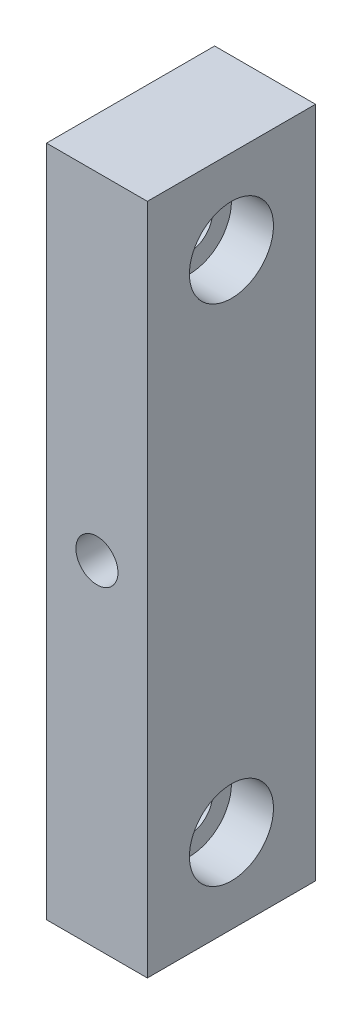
ISO-10303-21;
HEADER;
FILE_DESCRIPTION(('STEP AP214'),'2;1');
FILE_NAME('part.step','',(''),(''),'','','');
FILE_SCHEMA(('AUTOMOTIVE_DESIGN { 1 0 10303 214 1 1 1 1 }'));
ENDSEC;
DATA;
#1=APPLICATION_CONTEXT('core data for automotive mechanical design processes');
#2=APPLICATION_PROTOCOL_DEFINITION('international standard','automotive_design',2000,#1);
#3=PRODUCT_CONTEXT('',#1,'mechanical');
#4=PRODUCT('Part','Part','',(#3));
#5=PRODUCT_RELATED_PRODUCT_CATEGORY('part','',(#4));
#6=PRODUCT_DEFINITION_FORMATION('','',#4);
#7=PRODUCT_DEFINITION_CONTEXT('part definition',#1,'design');
#8=PRODUCT_DEFINITION('design','',#6,#7);
#9=PRODUCT_DEFINITION_SHAPE('','',#8);
#10=(LENGTH_UNIT() NAMED_UNIT(*) SI_UNIT(.MILLI.,.METRE.));
#11=(NAMED_UNIT(*) PLANE_ANGLE_UNIT() SI_UNIT($,.RADIAN.));
#12=(NAMED_UNIT(*) SI_UNIT($,.STERADIAN.) SOLID_ANGLE_UNIT());
#13=UNCERTAINTY_MEASURE_WITH_UNIT(LENGTH_MEASURE(1.E-05),#10,'distance_accuracy_value','');
#14=(GEOMETRIC_REPRESENTATION_CONTEXT(3) GLOBAL_UNCERTAINTY_ASSIGNED_CONTEXT((#13)) GLOBAL_UNIT_ASSIGNED_CONTEXT((#10,
#11,#12)) REPRESENTATION_CONTEXT('',''));
#15=CARTESIAN_POINT('',(0.,0.,0.));
#16=DIRECTION('',(0.,0.,1.));
#17=DIRECTION('',(1.,0.,0.));
#18=AXIS2_PLACEMENT_3D('',#15,#16,#17);
#19=CARTESIAN_POINT('',(7.,-30.,0.));
#20=DIRECTION('',(1.,0.,0.));
#21=DIRECTION('',(0.,0.,-1.));
#22=AXIS2_PLACEMENT_3D('',#19,#20,#21);
#23=CYLINDRICAL_SURFACE('',#22,5.);
#24=CARTESIAN_POINT('',(12.,-30.,0.));
#25=DIRECTION('',(1.,0.,0.));
#26=DIRECTION('',(0.,0.,-1.));
#27=AXIS2_PLACEMENT_3D('',#24,#25,#26);
#28=CIRCLE('',#27,5.);
#29=CARTESIAN_POINT('',(12.,-30.,-4.99999999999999));
#30=VERTEX_POINT('',#29);
#31=EDGE_CURVE('E105',#30,#30,#28,.F.);
#32=ORIENTED_EDGE('',*,*,#31,.F.);
#33=EDGE_LOOP('',(#32));
#34=FACE_BOUND('',#33,.T.);
#35=CARTESIAN_POINT('',(7.,-30.,0.));
#36=DIRECTION('',(1.,0.,0.));
#37=DIRECTION('',(0.,0.,-1.));
#38=AXIS2_PLACEMENT_3D('',#35,#36,#37);
#39=CIRCLE('',#38,5.);
#40=CARTESIAN_POINT('',(7.,-30.,-4.99999999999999));
#41=VERTEX_POINT('',#40);
#42=EDGE_CURVE('E20',#41,#41,#39,.T.);
#43=ORIENTED_EDGE('',*,*,#42,.F.);
#44=EDGE_LOOP('',(#43));
#45=FACE_BOUND('',#44,.T.);
#46=ADVANCED_FACE('F17',(#34,#45),#23,.F.);
#47=CARTESIAN_POINT('',(7.,30.,0.));
#48=DIRECTION('',(1.,0.,0.));
#49=DIRECTION('',(0.,0.,-1.));
#50=AXIS2_PLACEMENT_3D('',#47,#48,#49);
#51=CYLINDRICAL_SURFACE('',#50,5.);
#52=CARTESIAN_POINT('',(12.,30.,0.));
#53=DIRECTION('',(1.,0.,0.));
#54=DIRECTION('',(0.,0.,-1.));
#55=AXIS2_PLACEMENT_3D('',#52,#53,#54);
#56=CIRCLE('',#55,5.);
#57=CARTESIAN_POINT('',(12.,30.,-4.99999999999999));
#58=VERTEX_POINT('',#57);
#59=EDGE_CURVE('E102',#58,#58,#56,.F.);
#60=ORIENTED_EDGE('',*,*,#59,.F.);
#61=EDGE_LOOP('',(#60));
#62=FACE_BOUND('',#61,.T.);
#63=CARTESIAN_POINT('',(7.,30.,0.));
#64=DIRECTION('',(1.,0.,0.));
#65=DIRECTION('',(0.,0.,-1.));
#66=AXIS2_PLACEMENT_3D('',#63,#64,#65);
#67=CIRCLE('',#66,5.);
#68=CARTESIAN_POINT('',(7.,30.,-4.99999999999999));
#69=VERTEX_POINT('',#68);
#70=EDGE_CURVE('E107',#69,#69,#67,.T.);
#71=ORIENTED_EDGE('',*,*,#70,.F.);
#72=EDGE_LOOP('',(#71));
#73=FACE_BOUND('',#72,.T.);
#74=ADVANCED_FACE('F117',(#62,#73),#51,.F.);
#75=CARTESIAN_POINT('',(7.,-30.,0.));
#76=DIRECTION('',(1.,0.,0.));
#77=DIRECTION('',(0.,0.,-1.));
#78=AXIS2_PLACEMENT_3D('',#75,#76,#77);
#79=PLANE('',#78);
#80=CARTESIAN_POINT('',(7.,-30.,0.));
#81=DIRECTION('',(1.,0.,0.));
#82=DIRECTION('',(0.,0.,-1.));
#83=AXIS2_PLACEMENT_3D('',#80,#81,#82);
#84=CIRCLE('',#83,2.75);
#85=CARTESIAN_POINT('',(7.,-30.,-2.74999999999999));
#86=VERTEX_POINT('',#85);
#87=EDGE_CURVE('E99',#86,#86,#84,.F.);
#88=ORIENTED_EDGE('',*,*,#87,.T.);
#89=EDGE_LOOP('',(#88));
#90=FACE_BOUND('',#89,.T.);
#91=ORIENTED_EDGE('',*,*,#42,.T.);
#92=EDGE_LOOP('',(#91));
#93=FACE_BOUND('',#92,.T.);
#94=ADVANCED_FACE('F114',(#90,#93),#79,.T.);
#95=CARTESIAN_POINT('',(7.,30.,0.));
#96=DIRECTION('',(1.,0.,0.));
#97=DIRECTION('',(0.,0.,-1.));
#98=AXIS2_PLACEMENT_3D('',#95,#96,#97);
#99=PLANE('',#98);
#100=CARTESIAN_POINT('',(7.,30.,0.));
#101=DIRECTION('',(1.,0.,0.));
#102=DIRECTION('',(0.,0.,-1.));
#103=AXIS2_PLACEMENT_3D('',#100,#101,#102);
#104=CIRCLE('',#103,2.75);
#105=CARTESIAN_POINT('',(7.,30.,-2.74999999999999));
#106=VERTEX_POINT('',#105);
#107=EDGE_CURVE('E67',#106,#106,#104,.F.);
#108=ORIENTED_EDGE('',*,*,#107,.T.);
#109=EDGE_LOOP('',(#108));
#110=FACE_BOUND('',#109,.T.);
#111=ORIENTED_EDGE('',*,*,#70,.T.);
#112=EDGE_LOOP('',(#111));
#113=FACE_BOUND('',#112,.T.);
#114=ADVANCED_FACE('F158',(#110,#113),#99,.T.);
#115=CARTESIAN_POINT('',(6.,0.,10.));
#116=DIRECTION('',(0.,0.,1.));
#117=DIRECTION('',(1.,0.,0.));
#118=AXIS2_PLACEMENT_3D('',#115,#116,#117);
#119=CYLINDRICAL_SURFACE('',#118,2.49999999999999);
#120=CARTESIAN_POINT('',(6.,0.,-10.));
#121=DIRECTION('',(0.,0.,1.));
#122=DIRECTION('',(1.,0.,0.));
#123=AXIS2_PLACEMENT_3D('',#120,#121,#122);
#124=CIRCLE('',#123,2.49999999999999);
#125=CARTESIAN_POINT('',(8.49999999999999,0.,-10.));
#126=VERTEX_POINT('',#125);
#127=EDGE_CURVE('E93',#126,#126,#124,.F.);
#128=ORIENTED_EDGE('',*,*,#127,.T.);
#129=EDGE_LOOP('',(#128));
#130=FACE_BOUND('',#129,.T.);
#131=CARTESIAN_POINT('',(6.,0.,10.));
#132=DIRECTION('',(0.,0.,1.));
#133=DIRECTION('',(1.,0.,0.));
#134=AXIS2_PLACEMENT_3D('',#131,#132,#133);
#135=CIRCLE('',#134,2.49999999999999);
#136=CARTESIAN_POINT('',(8.49999999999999,0.,10.));
#137=VERTEX_POINT('',#136);
#138=EDGE_CURVE('E66',#137,#137,#135,.T.);
#139=ORIENTED_EDGE('',*,*,#138,.T.);
#140=EDGE_LOOP('',(#139));
#141=FACE_BOUND('',#140,.T.);
#142=ADVANCED_FACE('F155',(#130,#141),#119,.F.);
#143=CARTESIAN_POINT('',(12.,0.,0.));
#144=DIRECTION('',(1.,0.,0.));
#145=DIRECTION('',(0.,0.,-1.));
#146=AXIS2_PLACEMENT_3D('',#143,#144,#145);
#147=PLANE('',#146);
#148=DIRECTION('',(0.,1.,0.));
#149=VECTOR('',#148,1.);
#150=CARTESIAN_POINT('',(12.,40.,10.));
#151=LINE('',#150,#149);
#152=CARTESIAN_POINT('',(12.,40.,10.));
#153=VERTEX_POINT('',#152);
#154=CARTESIAN_POINT('',(12.,-40.,10.));
#155=VERTEX_POINT('',#154);
#156=EDGE_CURVE('E55',#153,#155,#151,.F.);
#157=ORIENTED_EDGE('',*,*,#156,.T.);
#158=DIRECTION('',(0.,0.,1.));
#159=VECTOR('',#158,1.);
#160=CARTESIAN_POINT('',(12.,-40.,10.));
#161=LINE('',#160,#159);
#162=CARTESIAN_POINT('',(12.,-40.,-10.));
#163=VERTEX_POINT('',#162);
#164=EDGE_CURVE('E95',#155,#163,#161,.F.);
#165=ORIENTED_EDGE('',*,*,#164,.T.);
#166=DIRECTION('',(0.,-1.,0.));
#167=VECTOR('',#166,1.);
#168=CARTESIAN_POINT('',(12.,40.,-9.99999999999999));
#169=LINE('',#168,#167);
#170=CARTESIAN_POINT('',(12.,40.,-10.));
#171=VERTEX_POINT('',#170);
#172=EDGE_CURVE('E61',#163,#171,#169,.F.);
#173=ORIENTED_EDGE('',*,*,#172,.T.);
#174=DIRECTION('',(0.,0.,-1.));
#175=VECTOR('',#174,1.);
#176=CARTESIAN_POINT('',(12.,40.,10.));
#177=LINE('',#176,#175);
#178=EDGE_CURVE('E58',#171,#153,#177,.F.);
#179=ORIENTED_EDGE('',*,*,#178,.T.);
#180=EDGE_LOOP('',(#157,#165,#173,#179));
#181=FACE_BOUND('',#180,.T.);
#182=ORIENTED_EDGE('',*,*,#59,.T.);
#183=EDGE_LOOP('',(#182));
#184=FACE_BOUND('',#183,.T.);
#185=ORIENTED_EDGE('',*,*,#31,.T.);
#186=EDGE_LOOP('',(#185));
#187=FACE_BOUND('',#186,.T.);
#188=ADVANCED_FACE('F59',(#181,#184,#187),#147,.T.);
#189=CARTESIAN_POINT('',(0.,-30.,0.));
#190=DIRECTION('',(1.,0.,0.));
#191=DIRECTION('',(0.,0.,-1.));
#192=AXIS2_PLACEMENT_3D('',#189,#190,#191);
#193=CYLINDRICAL_SURFACE('',#192,2.75);
#194=CARTESIAN_POINT('',(0.,-30.,0.));
#195=DIRECTION('',(1.,0.,0.));
#196=DIRECTION('',(0.,0.,-1.));
#197=AXIS2_PLACEMENT_3D('',#194,#195,#196);
#198=CIRCLE('',#197,2.75);
#199=CARTESIAN_POINT('',(0.,-30.,-2.74999999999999));
#200=VERTEX_POINT('',#199);
#201=EDGE_CURVE('E89',#200,#200,#198,.F.);
#202=ORIENTED_EDGE('',*,*,#201,.T.);
#203=EDGE_LOOP('',(#202));
#204=FACE_BOUND('',#203,.T.);
#205=ORIENTED_EDGE('',*,*,#87,.F.);
#206=EDGE_LOOP('',(#205));
#207=FACE_BOUND('',#206,.T.);
#208=ADVANCED_FACE('F148',(#204,#207),#193,.F.);
#209=CARTESIAN_POINT('',(0.,30.,0.));
#210=DIRECTION('',(1.,0.,0.));
#211=DIRECTION('',(0.,0.,-1.));
#212=AXIS2_PLACEMENT_3D('',#209,#210,#211);
#213=CYLINDRICAL_SURFACE('',#212,2.75);
#214=CARTESIAN_POINT('',(0.,30.,0.));
#215=DIRECTION('',(1.,0.,0.));
#216=DIRECTION('',(0.,0.,-1.));
#217=AXIS2_PLACEMENT_3D('',#214,#215,#216);
#218=CIRCLE('',#217,2.75);
#219=CARTESIAN_POINT('',(0.,30.,-2.74999999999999));
#220=VERTEX_POINT('',#219);
#221=EDGE_CURVE('E86',#220,#220,#218,.F.);
#222=ORIENTED_EDGE('',*,*,#221,.T.);
#223=EDGE_LOOP('',(#222));
#224=FACE_BOUND('',#223,.T.);
#225=ORIENTED_EDGE('',*,*,#107,.F.);
#226=EDGE_LOOP('',(#225));
#227=FACE_BOUND('',#226,.T.);
#228=ADVANCED_FACE('F145',(#224,#227),#213,.F.);
#229=CARTESIAN_POINT('',(12.,40.,10.));
#230=DIRECTION('',(0.,-1.,0.));
#231=DIRECTION('',(0.,0.,-1.));
#232=AXIS2_PLACEMENT_3D('',#229,#230,#231);
#233=PLANE('',#232);
#234=DIRECTION('',(1.,0.,0.));
#235=VECTOR('',#234,1.);
#236=CARTESIAN_POINT('',(12.,40.,10.));
#237=LINE('',#236,#235);
#238=CARTESIAN_POINT('',(0.,40.,10.));
#239=VERTEX_POINT('',#238);
#240=EDGE_CURVE('E74',#239,#153,#237,.T.);
#241=ORIENTED_EDGE('',*,*,#240,.T.);
#242=ORIENTED_EDGE('',*,*,#178,.F.);
#243=DIRECTION('',(1.,0.,0.));
#244=VECTOR('',#243,1.);
#245=CARTESIAN_POINT('',(12.,40.,-9.99999999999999));
#246=LINE('',#245,#244);
#247=CARTESIAN_POINT('',(0.,40.,-9.99999999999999));
#248=VERTEX_POINT('',#247);
#249=EDGE_CURVE('E92',#171,#248,#246,.F.);
#250=ORIENTED_EDGE('',*,*,#249,.T.);
#251=DIRECTION('',(0.,0.,-1.));
#252=VECTOR('',#251,1.);
#253=CARTESIAN_POINT('',(0.,40.,0.));
#254=LINE('',#253,#252);
#255=EDGE_CURVE('E80',#248,#239,#254,.F.);
#256=ORIENTED_EDGE('',*,*,#255,.T.);
#257=EDGE_LOOP('',(#241,#242,#250,#256));
#258=FACE_BOUND('',#257,.T.);
#259=ADVANCED_FACE('F79',(#258),#233,.F.);
#260=CARTESIAN_POINT('',(12.,40.,10.));
#261=DIRECTION('',(0.,0.,-1.));
#262=DIRECTION('',(0.,1.,0.));
#263=AXIS2_PLACEMENT_3D('',#260,#261,#262);
#264=PLANE('',#263);
#265=DIRECTION('',(1.,0.,0.));
#266=VECTOR('',#265,1.);
#267=CARTESIAN_POINT('',(12.,-40.,10.));
#268=LINE('',#267,#266);
#269=CARTESIAN_POINT('',(0.,-40.,10.));
#270=VERTEX_POINT('',#269);
#271=EDGE_CURVE('E76',#270,#155,#268,.T.);
#272=ORIENTED_EDGE('',*,*,#271,.T.);
#273=ORIENTED_EDGE('',*,*,#156,.F.);
#274=ORIENTED_EDGE('',*,*,#240,.F.);
#275=DIRECTION('',(0.,1.,0.));
#276=VECTOR('',#275,1.);
#277=CARTESIAN_POINT('',(0.,0.,10.));
#278=LINE('',#277,#276);
#279=EDGE_CURVE('E293',#239,#270,#278,.F.);
#280=ORIENTED_EDGE('',*,*,#279,.T.);
#281=EDGE_LOOP('',(#272,#273,#274,#280));
#282=FACE_BOUND('',#281,.T.);
#283=ORIENTED_EDGE('',*,*,#138,.F.);
#284=EDGE_LOOP('',(#283));
#285=FACE_BOUND('',#284,.T.);
#286=ADVANCED_FACE('F71',(#282,#285),#264,.F.);
#287=CARTESIAN_POINT('',(12.,-40.,10.));
#288=DIRECTION('',(0.,1.,0.));
#289=DIRECTION('',(0.,0.,1.));
#290=AXIS2_PLACEMENT_3D('',#287,#288,#289);
#291=PLANE('',#290);
#292=DIRECTION('',(1.,0.,0.));
#293=VECTOR('',#292,1.);
#294=CARTESIAN_POINT('',(12.,-40.,-10.));
#295=LINE('',#294,#293);
#296=CARTESIAN_POINT('',(0.,-40.,-10.));
#297=VERTEX_POINT('',#296);
#298=EDGE_CURVE('E34',#297,#163,#295,.T.);
#299=ORIENTED_EDGE('',*,*,#298,.T.);
#300=ORIENTED_EDGE('',*,*,#164,.F.);
#301=ORIENTED_EDGE('',*,*,#271,.F.);
#302=DIRECTION('',(0.,0.,-1.));
#303=VECTOR('',#302,1.);
#304=CARTESIAN_POINT('',(0.,-40.,0.));
#305=LINE('',#304,#303);
#306=EDGE_CURVE('E26',#270,#297,#305,.T.);
#307=ORIENTED_EDGE('',*,*,#306,.T.);
#308=EDGE_LOOP('',(#299,#300,#301,#307));
#309=FACE_BOUND('',#308,.T.);
#310=ADVANCED_FACE('F133',(#309),#291,.F.);
#311=CARTESIAN_POINT('',(12.,40.,-9.99999999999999));
#312=DIRECTION('',(0.,0.,1.));
#313=DIRECTION('',(0.,-1.,0.));
#314=AXIS2_PLACEMENT_3D('',#311,#312,#313);
#315=PLANE('',#314);
#316=ORIENTED_EDGE('',*,*,#249,.F.);
#317=ORIENTED_EDGE('',*,*,#172,.F.);
#318=ORIENTED_EDGE('',*,*,#298,.F.);
#319=DIRECTION('',(0.,1.,0.));
#320=VECTOR('',#319,1.);
#321=CARTESIAN_POINT('',(0.,0.,-10.));
#322=LINE('',#321,#320);
#323=EDGE_CURVE('E11',#297,#248,#322,.T.);
#324=ORIENTED_EDGE('',*,*,#323,.T.);
#325=EDGE_LOOP('',(#316,#317,#318,#324));
#326=FACE_BOUND('',#325,.T.);
#327=ORIENTED_EDGE('',*,*,#127,.F.);
#328=EDGE_LOOP('',(#327));
#329=FACE_BOUND('',#328,.T.);
#330=ADVANCED_FACE('F127',(#326,#329),#315,.F.);
#331=CARTESIAN_POINT('',(0.,0.,0.));
#332=DIRECTION('',(1.,0.,0.));
#333=DIRECTION('',(0.,0.,-1.));
#334=AXIS2_PLACEMENT_3D('',#331,#332,#333);
#335=PLANE('',#334);
#336=ORIENTED_EDGE('',*,*,#306,.F.);
#337=ORIENTED_EDGE('',*,*,#279,.F.);
#338=ORIENTED_EDGE('',*,*,#255,.F.);
#339=ORIENTED_EDGE('',*,*,#323,.F.);
#340=EDGE_LOOP('',(#336,#337,#338,#339));
#341=FACE_BOUND('',#340,.T.);
#342=ORIENTED_EDGE('',*,*,#221,.F.);
#343=EDGE_LOOP('',(#342));
#344=FACE_BOUND('',#343,.T.);
#345=ORIENTED_EDGE('',*,*,#201,.F.);
#346=EDGE_LOOP('',(#345));
#347=FACE_BOUND('',#346,.T.);
#348=ADVANCED_FACE('F125',(#341,#344,#347),#335,.F.);
#349=CLOSED_SHELL('',(#46,#74,#94,#114,#142,#188,#208,#228,#259,#286,#310,#330,#348));
#350=MANIFOLD_SOLID_BREP('B1',#349);
#351=ADVANCED_BREP_SHAPE_REPRESENTATION('',(#18,#350),#14);
#352=SHAPE_DEFINITION_REPRESENTATION(#9,#351);
ENDSEC;
END-ISO-10303-21;
